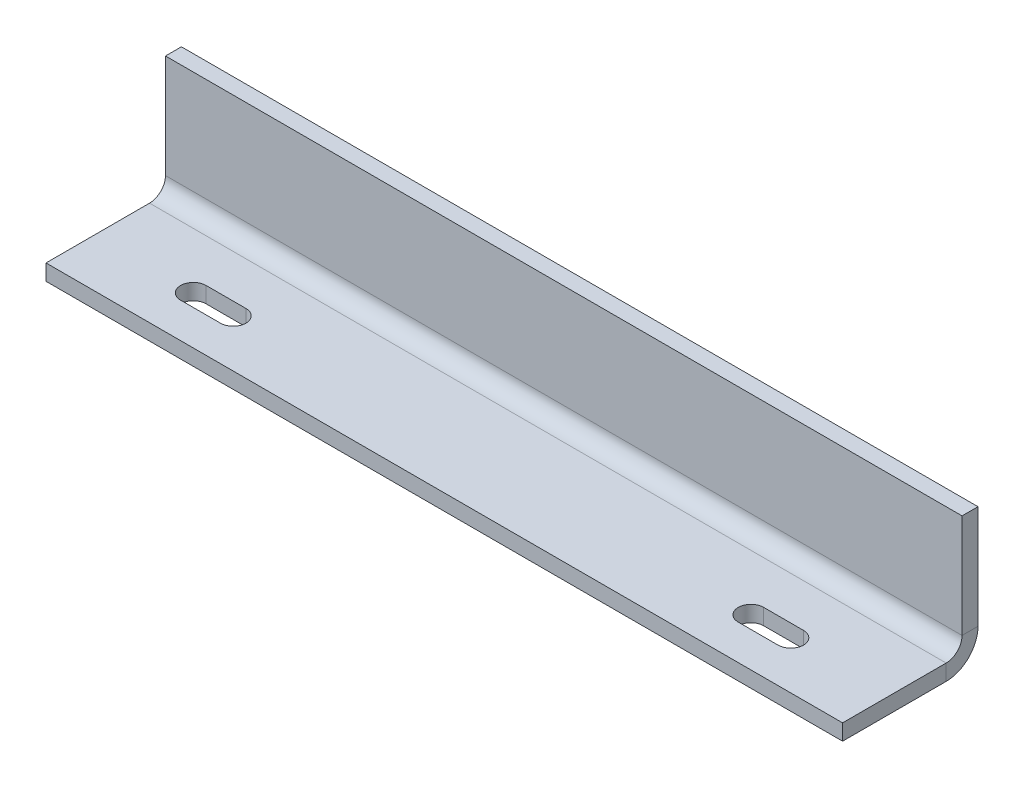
ISO-10303-21;
HEADER;
FILE_DESCRIPTION(('STEP AP214'),'2;1');
FILE_NAME('part.step','',(''),(''),'','','');
FILE_SCHEMA(('AUTOMOTIVE_DESIGN { 1 0 10303 214 1 1 1 1 }'));
ENDSEC;
DATA;
#1=APPLICATION_CONTEXT('core data for automotive mechanical design processes');
#2=APPLICATION_PROTOCOL_DEFINITION('international standard','automotive_design',2000,#1);
#3=PRODUCT_CONTEXT('',#1,'mechanical');
#4=PRODUCT('Part','Part','',(#3));
#5=PRODUCT_RELATED_PRODUCT_CATEGORY('part','',(#4));
#6=PRODUCT_DEFINITION_FORMATION('','',#4);
#7=PRODUCT_DEFINITION_CONTEXT('part definition',#1,'design');
#8=PRODUCT_DEFINITION('design','',#6,#7);
#9=PRODUCT_DEFINITION_SHAPE('','',#8);
#10=(LENGTH_UNIT() NAMED_UNIT(*) SI_UNIT(.MILLI.,.METRE.));
#11=(NAMED_UNIT(*) PLANE_ANGLE_UNIT() SI_UNIT($,.RADIAN.));
#12=(NAMED_UNIT(*) SI_UNIT($,.STERADIAN.) SOLID_ANGLE_UNIT());
#13=UNCERTAINTY_MEASURE_WITH_UNIT(LENGTH_MEASURE(1.E-05),#10,'distance_accuracy_value','');
#14=(GEOMETRIC_REPRESENTATION_CONTEXT(3) GLOBAL_UNCERTAINTY_ASSIGNED_CONTEXT((#13)) GLOBAL_UNIT_ASSIGNED_CONTEXT((#10,
#11,#12)) REPRESENTATION_CONTEXT('',''));
#15=CARTESIAN_POINT('',(0.,0.,0.));
#16=DIRECTION('',(0.,0.,1.));
#17=DIRECTION('',(1.,0.,0.));
#18=AXIS2_PLACEMENT_3D('',#15,#16,#17);
#19=CARTESIAN_POINT('',(50.,2.,0.));
#20=DIRECTION('',(1.,0.,0.));
#21=DIRECTION('',(0.,0.,-1.));
#22=AXIS2_PLACEMENT_3D('',#19,#20,#21);
#23=PLANE('',#22);
#24=DIRECTION('',(0.,0.,-1.));
#25=VECTOR('',#24,1.);
#26=CARTESIAN_POINT('',(50.,2.,0.));
#27=LINE('',#26,#25);
#28=CARTESIAN_POINT('',(50.,2.,0.));
#29=VERTEX_POINT('',#28);
#30=CARTESIAN_POINT('',(50.,2.,-2.00000000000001));
#31=VERTEX_POINT('',#30);
#32=EDGE_CURVE('E11',#29,#31,#27,.T.);
#33=ORIENTED_EDGE('',*,*,#32,.F.);
#34=CARTESIAN_POINT('',(50.,2.,2.));
#35=DIRECTION('',(-1.,0.,0.));
#36=DIRECTION('',(0.,0.,1.));
#37=AXIS2_PLACEMENT_3D('',#34,#35,#36);
#38=CIRCLE('',#37,2.);
#39=CARTESIAN_POINT('',(50.,0.,2.));
#40=VERTEX_POINT('',#39);
#41=EDGE_CURVE('E219',#40,#29,#38,.F.);
#42=ORIENTED_EDGE('',*,*,#41,.F.);
#43=DIRECTION('',(0.,1.,0.));
#44=VECTOR('',#43,1.);
#45=CARTESIAN_POINT('',(50.,-2.,2.00000000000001));
#46=LINE('',#45,#44);
#47=CARTESIAN_POINT('',(50.,-2.,2.00000000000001));
#48=VERTEX_POINT('',#47);
#49=EDGE_CURVE('E41',#48,#40,#46,.T.);
#50=ORIENTED_EDGE('',*,*,#49,.F.);
#51=CARTESIAN_POINT('',(50.,2.,2.));
#52=DIRECTION('',(1.,0.,0.));
#53=DIRECTION('',(0.,0.,-1.));
#54=AXIS2_PLACEMENT_3D('',#51,#52,#53);
#55=CIRCLE('',#54,4.);
#56=EDGE_CURVE('E231',#48,#31,#55,.T.);
#57=ORIENTED_EDGE('',*,*,#56,.T.);
#58=EDGE_LOOP('',(#33,#42,#50,#57));
#59=FACE_BOUND('',#58,.T.);
#60=ADVANCED_FACE('F34',(#59),#23,.T.);
#61=CARTESIAN_POINT('',(50.,-2.,2.00000000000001));
#62=DIRECTION('',(1.,0.,0.));
#63=DIRECTION('',(0.,0.,-1.));
#64=AXIS2_PLACEMENT_3D('',#61,#62,#63);
#65=PLANE('',#64);
#66=DIRECTION('',(0.,1.,0.));
#67=VECTOR('',#66,1.);
#68=CARTESIAN_POINT('',(50.,0.,0.));
#69=LINE('',#68,#67);
#70=CARTESIAN_POINT('',(50.,15.,0.));
#71=VERTEX_POINT('',#70);
#72=EDGE_CURVE('E216',#29,#71,#69,.T.);
#73=ORIENTED_EDGE('',*,*,#72,.F.);
#74=ORIENTED_EDGE('',*,*,#32,.T.);
#75=DIRECTION('',(0.,1.,0.));
#76=VECTOR('',#75,1.);
#77=CARTESIAN_POINT('',(50.,0.,-2.));
#78=LINE('',#77,#76);
#79=CARTESIAN_POINT('',(50.,15.,-2.00000000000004));
#80=VERTEX_POINT('',#79);
#81=EDGE_CURVE('E210',#31,#80,#78,.T.);
#82=ORIENTED_EDGE('',*,*,#81,.T.);
#83=DIRECTION('',(0.,0.,-1.));
#84=VECTOR('',#83,1.);
#85=CARTESIAN_POINT('',(50.,15.,0.));
#86=LINE('',#85,#84);
#87=EDGE_CURVE('E212',#71,#80,#86,.T.);
#88=ORIENTED_EDGE('',*,*,#87,.F.);
#89=EDGE_LOOP('',(#73,#74,#82,#88));
#90=FACE_BOUND('',#89,.T.);
#91=ADVANCED_FACE('F313',(#90),#65,.T.);
#92=CARTESIAN_POINT('',(-50.,0.,2.));
#93=DIRECTION('',(-1.,0.,0.));
#94=DIRECTION('',(0.,0.,1.));
#95=AXIS2_PLACEMENT_3D('',#92,#93,#94);
#96=PLANE('',#95);
#97=DIRECTION('',(0.,-1.,0.));
#98=VECTOR('',#97,1.);
#99=CARTESIAN_POINT('',(-50.,0.,2.));
#100=LINE('',#99,#98);
#101=CARTESIAN_POINT('',(-50.,0.,2.));
#102=VERTEX_POINT('',#101);
#103=CARTESIAN_POINT('',(-50.,-2.,2.00000000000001));
#104=VERTEX_POINT('',#103);
#105=EDGE_CURVE('E278',#102,#104,#100,.T.);
#106=ORIENTED_EDGE('',*,*,#105,.F.);
#107=CARTESIAN_POINT('',(-50.,2.,2.));
#108=DIRECTION('',(-1.,0.,0.));
#109=DIRECTION('',(0.,0.,1.));
#110=AXIS2_PLACEMENT_3D('',#107,#108,#109);
#111=CIRCLE('',#110,2.);
#112=CARTESIAN_POINT('',(-50.,2.,0.));
#113=VERTEX_POINT('',#112);
#114=EDGE_CURVE('E243',#102,#113,#111,.F.);
#115=ORIENTED_EDGE('',*,*,#114,.T.);
#116=DIRECTION('',(0.,0.,1.));
#117=VECTOR('',#116,1.);
#118=CARTESIAN_POINT('',(-50.,2.,-2.00000000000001));
#119=LINE('',#118,#117);
#120=CARTESIAN_POINT('',(-50.,2.,-2.00000000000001));
#121=VERTEX_POINT('',#120);
#122=EDGE_CURVE('E276',#121,#113,#119,.T.);
#123=ORIENTED_EDGE('',*,*,#122,.F.);
#124=CARTESIAN_POINT('',(-50.,2.,2.));
#125=DIRECTION('',(1.,0.,0.));
#126=DIRECTION('',(0.,0.,-1.));
#127=AXIS2_PLACEMENT_3D('',#124,#125,#126);
#128=CIRCLE('',#127,4.);
#129=EDGE_CURVE('E213',#104,#121,#128,.T.);
#130=ORIENTED_EDGE('',*,*,#129,.F.);
#131=EDGE_LOOP('',(#106,#115,#123,#130));
#132=FACE_BOUND('',#131,.T.);
#133=ADVANCED_FACE('F320',(#132),#96,.T.);
#134=CARTESIAN_POINT('',(-50.,2.,-2.00000000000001));
#135=DIRECTION('',(-1.,0.,0.));
#136=DIRECTION('',(0.,0.,1.));
#137=AXIS2_PLACEMENT_3D('',#134,#135,#136);
#138=PLANE('',#137);
#139=DIRECTION('',(0.,0.,-1.));
#140=VECTOR('',#139,1.);
#141=CARTESIAN_POINT('',(-50.,0.,15.));
#142=LINE('',#141,#140);
#143=CARTESIAN_POINT('',(-50.,0.,15.));
#144=VERTEX_POINT('',#143);
#145=EDGE_CURVE('E246',#144,#102,#142,.T.);
#146=ORIENTED_EDGE('',*,*,#145,.T.);
#147=ORIENTED_EDGE('',*,*,#105,.T.);
#148=DIRECTION('',(0.,0.,-1.));
#149=VECTOR('',#148,1.);
#150=CARTESIAN_POINT('',(-50.,-2.00000000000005,15.));
#151=LINE('',#150,#149);
#152=CARTESIAN_POINT('',(-50.,-2.00000000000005,15.));
#153=VERTEX_POINT('',#152);
#154=EDGE_CURVE('E252',#153,#104,#151,.T.);
#155=ORIENTED_EDGE('',*,*,#154,.F.);
#156=DIRECTION('',(0.,1.,0.));
#157=VECTOR('',#156,1.);
#158=CARTESIAN_POINT('',(-50.,-2.00000000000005,15.));
#159=LINE('',#158,#157);
#160=EDGE_CURVE('E249',#153,#144,#159,.T.);
#161=ORIENTED_EDGE('',*,*,#160,.T.);
#162=EDGE_LOOP('',(#146,#147,#155,#161));
#163=FACE_BOUND('',#162,.T.);
#164=ADVANCED_FACE('F322',(#163),#138,.T.);
#165=CARTESIAN_POINT('',(50.,0.,-2.));
#166=DIRECTION('',(0.,0.,1.));
#167=DIRECTION('',(1.,0.,0.));
#168=AXIS2_PLACEMENT_3D('',#165,#166,#167);
#169=PLANE('',#168);
#170=DIRECTION('',(0.,1.,0.));
#171=VECTOR('',#170,1.);
#172=CARTESIAN_POINT('',(-50.,0.,-2.));
#173=LINE('',#172,#171);
#174=CARTESIAN_POINT('',(-50.,15.,-2.00000000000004));
#175=VERTEX_POINT('',#174);
#176=EDGE_CURVE('E209',#121,#175,#173,.T.);
#177=ORIENTED_EDGE('',*,*,#176,.T.);
#178=DIRECTION('',(-1.,0.,0.));
#179=VECTOR('',#178,1.);
#180=CARTESIAN_POINT('',(50.,15.,-2.00000000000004));
#181=LINE('',#180,#179);
#182=EDGE_CURVE('E274',#80,#175,#181,.T.);
#183=ORIENTED_EDGE('',*,*,#182,.F.);
#184=ORIENTED_EDGE('',*,*,#81,.F.);
#185=DIRECTION('',(-1.,0.,0.));
#186=VECTOR('',#185,1.);
#187=CARTESIAN_POINT('',(50.,2.,-2.00000000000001));
#188=LINE('',#187,#186);
#189=EDGE_CURVE('E234',#31,#121,#188,.T.);
#190=ORIENTED_EDGE('',*,*,#189,.T.);
#191=EDGE_LOOP('',(#177,#183,#184,#190));
#192=FACE_BOUND('',#191,.T.);
#193=ADVANCED_FACE('F309',(#192),#169,.F.);
#194=CARTESIAN_POINT('',(50.,15.,0.));
#195=DIRECTION('',(0.,1.,0.));
#196=DIRECTION('',(0.,0.,1.));
#197=AXIS2_PLACEMENT_3D('',#194,#195,#196);
#198=PLANE('',#197);
#199=DIRECTION('',(0.,0.,-1.));
#200=VECTOR('',#199,1.);
#201=CARTESIAN_POINT('',(-50.,15.,0.));
#202=LINE('',#201,#200);
#203=CARTESIAN_POINT('',(-50.,15.,0.));
#204=VERTEX_POINT('',#203);
#205=EDGE_CURVE('E237',#204,#175,#202,.T.);
#206=ORIENTED_EDGE('',*,*,#205,.F.);
#207=DIRECTION('',(-1.,0.,0.));
#208=VECTOR('',#207,1.);
#209=CARTESIAN_POINT('',(50.,15.,0.));
#210=LINE('',#209,#208);
#211=EDGE_CURVE('E272',#71,#204,#210,.T.);
#212=ORIENTED_EDGE('',*,*,#211,.F.);
#213=ORIENTED_EDGE('',*,*,#87,.T.);
#214=ORIENTED_EDGE('',*,*,#182,.T.);
#215=EDGE_LOOP('',(#206,#212,#213,#214));
#216=FACE_BOUND('',#215,.T.);
#217=ADVANCED_FACE('F329',(#216),#198,.T.);
#218=CARTESIAN_POINT('',(50.,0.,0.));
#219=DIRECTION('',(0.,0.,1.));
#220=DIRECTION('',(1.,0.,0.));
#221=AXIS2_PLACEMENT_3D('',#218,#219,#220);
#222=PLANE('',#221);
#223=DIRECTION('',(0.,1.,0.));
#224=VECTOR('',#223,1.);
#225=CARTESIAN_POINT('',(-50.,0.,0.));
#226=LINE('',#225,#224);
#227=EDGE_CURVE('E240',#113,#204,#226,.T.);
#228=ORIENTED_EDGE('',*,*,#227,.F.);
#229=DIRECTION('',(-1.,0.,0.));
#230=VECTOR('',#229,1.);
#231=CARTESIAN_POINT('',(50.,2.,0.));
#232=LINE('',#231,#230);
#233=EDGE_CURVE('E269',#29,#113,#232,.T.);
#234=ORIENTED_EDGE('',*,*,#233,.F.);
#235=ORIENTED_EDGE('',*,*,#72,.T.);
#236=ORIENTED_EDGE('',*,*,#211,.T.);
#237=EDGE_LOOP('',(#228,#234,#235,#236));
#238=FACE_BOUND('',#237,.T.);
#239=ADVANCED_FACE('F316',(#238),#222,.T.);
#240=CARTESIAN_POINT('',(50.,2.,2.));
#241=DIRECTION('',(-1.,0.,0.));
#242=DIRECTION('',(0.,0.,1.));
#243=AXIS2_PLACEMENT_3D('',#240,#241,#242);
#244=CYLINDRICAL_SURFACE('',#243,2.);
#245=ORIENTED_EDGE('',*,*,#114,.F.);
#246=DIRECTION('',(-1.,0.,0.));
#247=VECTOR('',#246,1.);
#248=CARTESIAN_POINT('',(50.,0.,2.));
#249=LINE('',#248,#247);
#250=EDGE_CURVE('E266',#40,#102,#249,.T.);
#251=ORIENTED_EDGE('',*,*,#250,.F.);
#252=ORIENTED_EDGE('',*,*,#41,.T.);
#253=ORIENTED_EDGE('',*,*,#233,.T.);
#254=EDGE_LOOP('',(#245,#251,#252,#253));
#255=FACE_BOUND('',#254,.T.);
#256=ADVANCED_FACE('F290',(#255),#244,.F.);
#257=CARTESIAN_POINT('',(50.,0.,15.));
#258=DIRECTION('',(0.,1.,0.));
#259=DIRECTION('',(0.,0.,1.));
#260=AXIS2_PLACEMENT_3D('',#257,#258,#259);
#261=PLANE('',#260);
#262=CARTESIAN_POINT('',(32.5,0.,9.00000000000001));
#263=DIRECTION('',(0.,1.,0.));
#264=DIRECTION('',(0.,0.,1.));
#265=AXIS2_PLACEMENT_3D('',#262,#263,#264);
#266=CIRCLE('',#265,1.6);
#267=CARTESIAN_POINT('',(32.5,0.,7.40000000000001));
#268=VERTEX_POINT('',#267);
#269=CARTESIAN_POINT('',(32.5,0.,10.6));
#270=VERTEX_POINT('',#269);
#271=EDGE_CURVE('E178',#268,#270,#266,.T.);
#272=ORIENTED_EDGE('',*,*,#271,.F.);
#273=DIRECTION('',(-1.,0.,0.));
#274=VECTOR('',#273,1.);
#275=CARTESIAN_POINT('',(50.,0.,7.40000000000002));
#276=LINE('',#275,#274);
#277=CARTESIAN_POINT('',(37.5,0.,7.40000000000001));
#278=VERTEX_POINT('',#277);
#279=EDGE_CURVE('E171',#278,#268,#276,.T.);
#280=ORIENTED_EDGE('',*,*,#279,.F.);
#281=CARTESIAN_POINT('',(37.5,0.,9.00000000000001));
#282=DIRECTION('',(0.,1.,0.));
#283=DIRECTION('',(0.,0.,1.));
#284=AXIS2_PLACEMENT_3D('',#281,#282,#283);
#285=CIRCLE('',#284,1.6);
#286=CARTESIAN_POINT('',(37.5,0.,10.6));
#287=VERTEX_POINT('',#286);
#288=EDGE_CURVE('E151',#287,#278,#285,.T.);
#289=ORIENTED_EDGE('',*,*,#288,.F.);
#290=DIRECTION('',(1.,0.,0.));
#291=VECTOR('',#290,1.);
#292=CARTESIAN_POINT('',(50.,0.,10.6));
#293=LINE('',#292,#291);
#294=EDGE_CURVE('E176',#270,#287,#293,.T.);
#295=ORIENTED_EDGE('',*,*,#294,.F.);
#296=EDGE_LOOP('',(#272,#280,#289,#295));
#297=FACE_BOUND('',#296,.T.);
#298=CARTESIAN_POINT('',(-37.5,0.,9.00000000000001));
#299=DIRECTION('',(0.,1.,0.));
#300=DIRECTION('',(0.,0.,1.));
#301=AXIS2_PLACEMENT_3D('',#298,#299,#300);
#302=CIRCLE('',#301,1.6);
#303=CARTESIAN_POINT('',(-37.5,0.,7.40000000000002));
#304=VERTEX_POINT('',#303);
#305=CARTESIAN_POINT('',(-37.5,0.,10.6));
#306=VERTEX_POINT('',#305);
#307=EDGE_CURVE('E207',#304,#306,#302,.T.);
#308=ORIENTED_EDGE('',*,*,#307,.F.);
#309=DIRECTION('',(-1.,0.,0.));
#310=VECTOR('',#309,1.);
#311=CARTESIAN_POINT('',(50.,0.,7.40000000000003));
#312=LINE('',#311,#310);
#313=CARTESIAN_POINT('',(-32.5,0.,7.40000000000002));
#314=VERTEX_POINT('',#313);
#315=EDGE_CURVE('E194',#314,#304,#312,.T.);
#316=ORIENTED_EDGE('',*,*,#315,.F.);
#317=CARTESIAN_POINT('',(-32.5,0.,9.00000000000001));
#318=DIRECTION('',(0.,1.,0.));
#319=DIRECTION('',(0.,0.,1.));
#320=AXIS2_PLACEMENT_3D('',#317,#318,#319);
#321=CIRCLE('',#320,1.6);
#322=CARTESIAN_POINT('',(-32.5,0.,10.6));
#323=VERTEX_POINT('',#322);
#324=EDGE_CURVE('E202',#323,#314,#321,.T.);
#325=ORIENTED_EDGE('',*,*,#324,.F.);
#326=DIRECTION('',(1.,0.,0.));
#327=VECTOR('',#326,1.);
#328=CARTESIAN_POINT('',(50.,0.,10.6));
#329=LINE('',#328,#327);
#330=EDGE_CURVE('E205',#306,#323,#329,.T.);
#331=ORIENTED_EDGE('',*,*,#330,.F.);
#332=EDGE_LOOP('',(#308,#316,#325,#331));
#333=FACE_BOUND('',#332,.T.);
#334=ORIENTED_EDGE('',*,*,#145,.F.);
#335=DIRECTION('',(-1.,0.,0.));
#336=VECTOR('',#335,1.);
#337=CARTESIAN_POINT('',(50.,0.,15.));
#338=LINE('',#337,#336);
#339=CARTESIAN_POINT('',(50.,0.,15.));
#340=VERTEX_POINT('',#339);
#341=EDGE_CURVE('E264',#340,#144,#338,.T.);
#342=ORIENTED_EDGE('',*,*,#341,.F.);
#343=DIRECTION('',(0.,0.,-1.));
#344=VECTOR('',#343,1.);
#345=CARTESIAN_POINT('',(50.,0.,15.));
#346=LINE('',#345,#344);
#347=EDGE_CURVE('E222',#340,#40,#346,.T.);
#348=ORIENTED_EDGE('',*,*,#347,.T.);
#349=ORIENTED_EDGE('',*,*,#250,.T.);
#350=EDGE_LOOP('',(#334,#342,#348,#349));
#351=FACE_BOUND('',#350,.T.);
#352=ADVANCED_FACE('F294',(#297,#333,#351),#261,.T.);
#353=CARTESIAN_POINT('',(50.,-2.00000000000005,15.));
#354=DIRECTION('',(0.,0.,1.));
#355=DIRECTION('',(1.,0.,0.));
#356=AXIS2_PLACEMENT_3D('',#353,#354,#355);
#357=PLANE('',#356);
#358=ORIENTED_EDGE('',*,*,#160,.F.);
#359=DIRECTION('',(-1.,0.,0.));
#360=VECTOR('',#359,1.);
#361=CARTESIAN_POINT('',(50.,-2.00000000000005,15.));
#362=LINE('',#361,#360);
#363=CARTESIAN_POINT('',(50.,-2.00000000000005,15.));
#364=VERTEX_POINT('',#363);
#365=EDGE_CURVE('E262',#364,#153,#362,.T.);
#366=ORIENTED_EDGE('',*,*,#365,.F.);
#367=DIRECTION('',(0.,1.,0.));
#368=VECTOR('',#367,1.);
#369=CARTESIAN_POINT('',(50.,-2.00000000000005,15.));
#370=LINE('',#369,#368);
#371=EDGE_CURVE('E225',#364,#340,#370,.T.);
#372=ORIENTED_EDGE('',*,*,#371,.T.);
#373=ORIENTED_EDGE('',*,*,#341,.T.);
#374=EDGE_LOOP('',(#358,#366,#372,#373));
#375=FACE_BOUND('',#374,.T.);
#376=ADVANCED_FACE('F297',(#375),#357,.T.);
#377=CARTESIAN_POINT('',(50.,-2.00000000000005,15.));
#378=DIRECTION('',(0.,1.,0.));
#379=DIRECTION('',(0.,0.,1.));
#380=AXIS2_PLACEMENT_3D('',#377,#378,#379);
#381=PLANE('',#380);
#382=DIRECTION('',(1.,0.,0.));
#383=VECTOR('',#382,1.);
#384=CARTESIAN_POINT('',(32.5,-2.00000000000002,7.40000000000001));
#385=LINE('',#384,#383);
#386=CARTESIAN_POINT('',(32.5,-2.00000000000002,7.40000000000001));
#387=VERTEX_POINT('',#386);
#388=CARTESIAN_POINT('',(37.5,-2.00000000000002,7.40000000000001));
#389=VERTEX_POINT('',#388);
#390=EDGE_CURVE('E157',#387,#389,#385,.T.);
#391=ORIENTED_EDGE('',*,*,#390,.F.);
#392=CARTESIAN_POINT('',(32.5,-2.00000000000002,9.00000000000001));
#393=DIRECTION('',(0.,-1.,0.));
#394=DIRECTION('',(0.,0.,-1.));
#395=AXIS2_PLACEMENT_3D('',#392,#393,#394);
#396=CIRCLE('',#395,1.6);
#397=CARTESIAN_POINT('',(32.5,-2.00000000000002,10.6));
#398=VERTEX_POINT('',#397);
#399=EDGE_CURVE('E56',#398,#387,#396,.T.);
#400=ORIENTED_EDGE('',*,*,#399,.F.);
#401=DIRECTION('',(-1.,0.,0.));
#402=VECTOR('',#401,1.);
#403=CARTESIAN_POINT('',(32.5,-2.00000000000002,10.6));
#404=LINE('',#403,#402);
#405=CARTESIAN_POINT('',(37.5,-2.00000000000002,10.6));
#406=VERTEX_POINT('',#405);
#407=EDGE_CURVE('E164',#406,#398,#404,.T.);
#408=ORIENTED_EDGE('',*,*,#407,.F.);
#409=CARTESIAN_POINT('',(37.5,-2.00000000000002,9.00000000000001));
#410=DIRECTION('',(0.,-1.,0.));
#411=DIRECTION('',(0.,0.,-1.));
#412=AXIS2_PLACEMENT_3D('',#409,#410,#411);
#413=CIRCLE('',#412,1.6);
#414=EDGE_CURVE('E148',#389,#406,#413,.T.);
#415=ORIENTED_EDGE('',*,*,#414,.F.);
#416=EDGE_LOOP('',(#391,#400,#408,#415));
#417=FACE_BOUND('',#416,.T.);
#418=DIRECTION('',(1.,0.,0.));
#419=VECTOR('',#418,1.);
#420=CARTESIAN_POINT('',(-37.5,-2.00000000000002,7.40000000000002));
#421=LINE('',#420,#419);
#422=CARTESIAN_POINT('',(-37.5,-2.00000000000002,7.40000000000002));
#423=VERTEX_POINT('',#422);
#424=CARTESIAN_POINT('',(-32.5,-2.00000000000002,7.40000000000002));
#425=VERTEX_POINT('',#424);
#426=EDGE_CURVE('E182',#423,#425,#421,.T.);
#427=ORIENTED_EDGE('',*,*,#426,.F.);
#428=CARTESIAN_POINT('',(-37.5,-2.00000000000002,9.00000000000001));
#429=DIRECTION('',(0.,-1.,0.));
#430=DIRECTION('',(0.,0.,-1.));
#431=AXIS2_PLACEMENT_3D('',#428,#429,#430);
#432=CIRCLE('',#431,1.6);
#433=CARTESIAN_POINT('',(-37.5,-2.00000000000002,10.6));
#434=VERTEX_POINT('',#433);
#435=EDGE_CURVE('E180',#434,#423,#432,.T.);
#436=ORIENTED_EDGE('',*,*,#435,.F.);
#437=DIRECTION('',(-1.,0.,0.));
#438=VECTOR('',#437,1.);
#439=CARTESIAN_POINT('',(-37.5,-2.00000000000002,10.6));
#440=LINE('',#439,#438);
#441=CARTESIAN_POINT('',(-32.5,-2.00000000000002,10.6));
#442=VERTEX_POINT('',#441);
#443=EDGE_CURVE('E188',#442,#434,#440,.T.);
#444=ORIENTED_EDGE('',*,*,#443,.F.);
#445=CARTESIAN_POINT('',(-32.5,-2.00000000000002,9.00000000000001));
#446=DIRECTION('',(0.,-1.,0.));
#447=DIRECTION('',(0.,0.,-1.));
#448=AXIS2_PLACEMENT_3D('',#445,#446,#447);
#449=CIRCLE('',#448,1.6);
#450=EDGE_CURVE('E185',#425,#442,#449,.T.);
#451=ORIENTED_EDGE('',*,*,#450,.F.);
#452=EDGE_LOOP('',(#427,#436,#444,#451));
#453=FACE_BOUND('',#452,.T.);
#454=ORIENTED_EDGE('',*,*,#154,.T.);
#455=DIRECTION('',(-1.,0.,0.));
#456=VECTOR('',#455,1.);
#457=CARTESIAN_POINT('',(50.,-2.,2.00000000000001));
#458=LINE('',#457,#456);
#459=EDGE_CURVE('E259',#48,#104,#458,.T.);
#460=ORIENTED_EDGE('',*,*,#459,.F.);
#461=DIRECTION('',(0.,0.,-1.));
#462=VECTOR('',#461,1.);
#463=CARTESIAN_POINT('',(50.,-2.00000000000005,15.));
#464=LINE('',#463,#462);
#465=EDGE_CURVE('E228',#364,#48,#464,.T.);
#466=ORIENTED_EDGE('',*,*,#465,.F.);
#467=ORIENTED_EDGE('',*,*,#365,.T.);
#468=EDGE_LOOP('',(#454,#460,#466,#467));
#469=FACE_BOUND('',#468,.T.);
#470=ADVANCED_FACE('F161',(#417,#453,#469),#381,.F.);
#471=CARTESIAN_POINT('',(50.,2.,2.));
#472=DIRECTION('',(-1.,0.,0.));
#473=DIRECTION('',(0.,0.,1.));
#474=AXIS2_PLACEMENT_3D('',#471,#472,#473);
#475=CYLINDRICAL_SURFACE('',#474,4.);
#476=ORIENTED_EDGE('',*,*,#129,.T.);
#477=ORIENTED_EDGE('',*,*,#189,.F.);
#478=ORIENTED_EDGE('',*,*,#56,.F.);
#479=ORIENTED_EDGE('',*,*,#459,.T.);
#480=EDGE_LOOP('',(#476,#477,#478,#479));
#481=FACE_BOUND('',#480,.T.);
#482=ADVANCED_FACE('F304',(#481),#475,.T.);
#483=CARTESIAN_POINT('',(50.,2.,2.));
#484=DIRECTION('',(-1.,0.,0.));
#485=DIRECTION('',(0.,0.,1.));
#486=AXIS2_PLACEMENT_3D('',#483,#484,#485);
#487=PLANE('',#486);
#488=ORIENTED_EDGE('',*,*,#465,.T.);
#489=ORIENTED_EDGE('',*,*,#49,.T.);
#490=ORIENTED_EDGE('',*,*,#347,.F.);
#491=ORIENTED_EDGE('',*,*,#371,.F.);
#492=EDGE_LOOP('',(#488,#489,#490,#491));
#493=FACE_BOUND('',#492,.T.);
#494=ADVANCED_FACE('F282',(#493),#487,.F.);
#495=CARTESIAN_POINT('',(-50.,2.,2.));
#496=DIRECTION('',(-1.,0.,0.));
#497=DIRECTION('',(0.,0.,1.));
#498=AXIS2_PLACEMENT_3D('',#495,#496,#497);
#499=PLANE('',#498);
#500=ORIENTED_EDGE('',*,*,#176,.F.);
#501=ORIENTED_EDGE('',*,*,#122,.T.);
#502=ORIENTED_EDGE('',*,*,#227,.T.);
#503=ORIENTED_EDGE('',*,*,#205,.T.);
#504=EDGE_LOOP('',(#500,#501,#502,#503));
#505=FACE_BOUND('',#504,.T.);
#506=ADVANCED_FACE('F429',(#505),#499,.T.);
#507=CARTESIAN_POINT('',(-37.5,15.,8.99999999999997));
#508=DIRECTION('',(0.,-1.,0.));
#509=DIRECTION('',(0.,0.,-1.));
#510=AXIS2_PLACEMENT_3D('',#507,#508,#509);
#511=CYLINDRICAL_SURFACE('',#510,1.6);
#512=ORIENTED_EDGE('',*,*,#307,.T.);
#513=DIRECTION('',(0.,-1.,0.));
#514=VECTOR('',#513,1.);
#515=CARTESIAN_POINT('',(-37.5,15.,10.6));
#516=LINE('',#515,#514);
#517=EDGE_CURVE('E192',#306,#434,#516,.T.);
#518=ORIENTED_EDGE('',*,*,#517,.T.);
#519=ORIENTED_EDGE('',*,*,#435,.T.);
#520=DIRECTION('',(0.,-1.,0.));
#521=VECTOR('',#520,1.);
#522=CARTESIAN_POINT('',(-37.5,15.,7.39999999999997));
#523=LINE('',#522,#521);
#524=EDGE_CURVE('E191',#304,#423,#523,.T.);
#525=ORIENTED_EDGE('',*,*,#524,.F.);
#526=EDGE_LOOP('',(#512,#518,#519,#525));
#527=FACE_BOUND('',#526,.T.);
#528=ADVANCED_FACE('F439',(#527),#511,.F.);
#529=CARTESIAN_POINT('',(-37.5,15.,10.6));
#530=DIRECTION('',(0.,0.,1.));
#531=DIRECTION('',(1.,0.,0.));
#532=AXIS2_PLACEMENT_3D('',#529,#530,#531);
#533=PLANE('',#532);
#534=ORIENTED_EDGE('',*,*,#330,.T.);
#535=DIRECTION('',(0.,-1.,0.));
#536=VECTOR('',#535,1.);
#537=CARTESIAN_POINT('',(-32.5,15.,10.6));
#538=LINE('',#537,#536);
#539=EDGE_CURVE('E195',#323,#442,#538,.T.);
#540=ORIENTED_EDGE('',*,*,#539,.T.);
#541=ORIENTED_EDGE('',*,*,#443,.T.);
#542=ORIENTED_EDGE('',*,*,#517,.F.);
#543=EDGE_LOOP('',(#534,#540,#541,#542));
#544=FACE_BOUND('',#543,.T.);
#545=ADVANCED_FACE('F449',(#544),#533,.F.);
#546=CARTESIAN_POINT('',(-32.5,15.,8.99999999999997));
#547=DIRECTION('',(0.,-1.,0.));
#548=DIRECTION('',(0.,0.,-1.));
#549=AXIS2_PLACEMENT_3D('',#546,#547,#548);
#550=CYLINDRICAL_SURFACE('',#549,1.6);
#551=ORIENTED_EDGE('',*,*,#324,.T.);
#552=DIRECTION('',(0.,-1.,0.));
#553=VECTOR('',#552,1.);
#554=CARTESIAN_POINT('',(-32.5,15.,7.39999999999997));
#555=LINE('',#554,#553);
#556=EDGE_CURVE('E197',#314,#425,#555,.T.);
#557=ORIENTED_EDGE('',*,*,#556,.T.);
#558=ORIENTED_EDGE('',*,*,#450,.T.);
#559=ORIENTED_EDGE('',*,*,#539,.F.);
#560=EDGE_LOOP('',(#551,#557,#558,#559));
#561=FACE_BOUND('',#560,.T.);
#562=ADVANCED_FACE('F460',(#561),#550,.F.);
#563=CARTESIAN_POINT('',(-37.5,15.,7.39999999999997));
#564=DIRECTION('',(0.,0.,-1.));
#565=DIRECTION('',(-1.,0.,0.));
#566=AXIS2_PLACEMENT_3D('',#563,#564,#565);
#567=PLANE('',#566);
#568=ORIENTED_EDGE('',*,*,#315,.T.);
#569=ORIENTED_EDGE('',*,*,#524,.T.);
#570=ORIENTED_EDGE('',*,*,#426,.T.);
#571=ORIENTED_EDGE('',*,*,#556,.F.);
#572=EDGE_LOOP('',(#568,#569,#570,#571));
#573=FACE_BOUND('',#572,.T.);
#574=ADVANCED_FACE('F471',(#573),#567,.F.);
#575=CARTESIAN_POINT('',(32.5,15.,8.99999999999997));
#576=DIRECTION('',(0.,-1.,0.));
#577=DIRECTION('',(0.,0.,-1.));
#578=AXIS2_PLACEMENT_3D('',#575,#576,#577);
#579=CYLINDRICAL_SURFACE('',#578,1.6);
#580=ORIENTED_EDGE('',*,*,#271,.T.);
#581=DIRECTION('',(0.,-1.,0.));
#582=VECTOR('',#581,1.);
#583=CARTESIAN_POINT('',(32.5,15.,10.6));
#584=LINE('',#583,#582);
#585=EDGE_CURVE('E169',#270,#398,#584,.T.);
#586=ORIENTED_EDGE('',*,*,#585,.T.);
#587=ORIENTED_EDGE('',*,*,#399,.T.);
#588=DIRECTION('',(0.,-1.,0.));
#589=VECTOR('',#588,1.);
#590=CARTESIAN_POINT('',(32.5,15.,7.39999999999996));
#591=LINE('',#590,#589);
#592=EDGE_CURVE('E154',#268,#387,#591,.T.);
#593=ORIENTED_EDGE('',*,*,#592,.F.);
#594=EDGE_LOOP('',(#580,#586,#587,#593));
#595=FACE_BOUND('',#594,.T.);
#596=ADVANCED_FACE('F482',(#595),#579,.F.);
#597=CARTESIAN_POINT('',(32.5,15.,10.6));
#598=DIRECTION('',(0.,0.,1.));
#599=DIRECTION('',(1.,0.,0.));
#600=AXIS2_PLACEMENT_3D('',#597,#598,#599);
#601=PLANE('',#600);
#602=ORIENTED_EDGE('',*,*,#294,.T.);
#603=DIRECTION('',(0.,-1.,0.));
#604=VECTOR('',#603,1.);
#605=CARTESIAN_POINT('',(37.5,15.,10.6));
#606=LINE('',#605,#604);
#607=EDGE_CURVE('E153',#287,#406,#606,.T.);
#608=ORIENTED_EDGE('',*,*,#607,.T.);
#609=ORIENTED_EDGE('',*,*,#407,.T.);
#610=ORIENTED_EDGE('',*,*,#585,.F.);
#611=EDGE_LOOP('',(#602,#608,#609,#610));
#612=FACE_BOUND('',#611,.T.);
#613=ADVANCED_FACE('F493',(#612),#601,.F.);
#614=CARTESIAN_POINT('',(37.5,15.,8.99999999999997));
#615=DIRECTION('',(0.,-1.,0.));
#616=DIRECTION('',(0.,0.,-1.));
#617=AXIS2_PLACEMENT_3D('',#614,#615,#616);
#618=CYLINDRICAL_SURFACE('',#617,1.6);
#619=ORIENTED_EDGE('',*,*,#288,.T.);
#620=DIRECTION('',(0.,-1.,0.));
#621=VECTOR('',#620,1.);
#622=CARTESIAN_POINT('',(37.5,15.,7.39999999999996));
#623=LINE('',#622,#621);
#624=EDGE_CURVE('E48',#278,#389,#623,.T.);
#625=ORIENTED_EDGE('',*,*,#624,.T.);
#626=ORIENTED_EDGE('',*,*,#414,.T.);
#627=ORIENTED_EDGE('',*,*,#607,.F.);
#628=EDGE_LOOP('',(#619,#625,#626,#627));
#629=FACE_BOUND('',#628,.T.);
#630=ADVANCED_FACE('F145',(#629),#618,.F.);
#631=CARTESIAN_POINT('',(32.5,15.,7.39999999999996));
#632=DIRECTION('',(0.,0.,-1.));
#633=DIRECTION('',(-1.,0.,0.));
#634=AXIS2_PLACEMENT_3D('',#631,#632,#633);
#635=PLANE('',#634);
#636=ORIENTED_EDGE('',*,*,#279,.T.);
#637=ORIENTED_EDGE('',*,*,#592,.T.);
#638=ORIENTED_EDGE('',*,*,#390,.T.);
#639=ORIENTED_EDGE('',*,*,#624,.F.);
#640=EDGE_LOOP('',(#636,#637,#638,#639));
#641=FACE_BOUND('',#640,.T.);
#642=ADVANCED_FACE('F158',(#641),#635,.F.);
#643=CLOSED_SHELL('',(#60,#91,#133,#164,#193,#217,#239,#256,#352,#376,#470,#482,#494,#506,#528,
#545,#562,#574,#596,#613,#630,#642));
#644=MANIFOLD_SOLID_BREP('B2',#643);
#645=ADVANCED_BREP_SHAPE_REPRESENTATION('',(#18,#644),#14);
#646=SHAPE_DEFINITION_REPRESENTATION(#9,#645);
ENDSEC;
END-ISO-10303-21;
